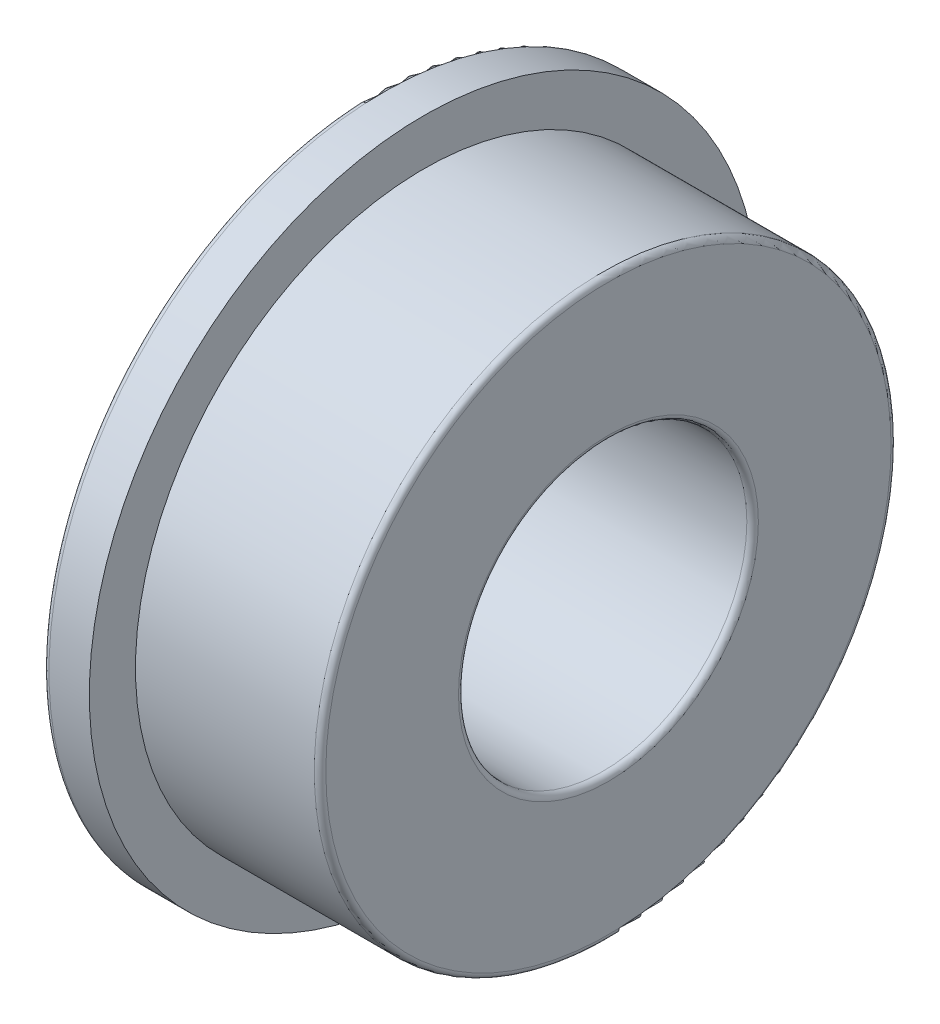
ISO-10303-21;
HEADER;
FILE_DESCRIPTION(('STEP AP214'),'2;1');
FILE_NAME('part.step','',(''),(''),'','','');
FILE_SCHEMA(('AUTOMOTIVE_DESIGN { 1 0 10303 214 1 1 1 1 }'));
ENDSEC;
DATA;
#1=APPLICATION_CONTEXT('core data for automotive mechanical design processes');
#2=APPLICATION_PROTOCOL_DEFINITION('international standard','automotive_design',2000,#1);
#3=PRODUCT_CONTEXT('',#1,'mechanical');
#4=PRODUCT('Part','Part','',(#3));
#5=PRODUCT_RELATED_PRODUCT_CATEGORY('part','',(#4));
#6=PRODUCT_DEFINITION_FORMATION('','',#4);
#7=PRODUCT_DEFINITION_CONTEXT('part definition',#1,'design');
#8=PRODUCT_DEFINITION('design','',#6,#7);
#9=PRODUCT_DEFINITION_SHAPE('','',#8);
#10=(LENGTH_UNIT() NAMED_UNIT(*) SI_UNIT(.MILLI.,.METRE.));
#11=(NAMED_UNIT(*) PLANE_ANGLE_UNIT() SI_UNIT($,.RADIAN.));
#12=(NAMED_UNIT(*) SI_UNIT($,.STERADIAN.) SOLID_ANGLE_UNIT());
#13=UNCERTAINTY_MEASURE_WITH_UNIT(LENGTH_MEASURE(1.E-05),#10,'distance_accuracy_value','');
#14=(GEOMETRIC_REPRESENTATION_CONTEXT(3) GLOBAL_UNCERTAINTY_ASSIGNED_CONTEXT((#13)) GLOBAL_UNIT_ASSIGNED_CONTEXT((#10,
#11,#12)) REPRESENTATION_CONTEXT('',''));
#15=CARTESIAN_POINT('',(0.,0.,0.));
#16=DIRECTION('',(0.,0.,1.));
#17=DIRECTION('',(1.,0.,0.));
#18=AXIS2_PLACEMENT_3D('',#15,#16,#17);
#19=CARTESIAN_POINT('',(0.8,0.,0.));
#20=DIRECTION('',(1.,0.,0.));
#21=DIRECTION('',(0.,0.,-1.));
#22=AXIS2_PLACEMENT_3D('',#19,#20,#21);
#23=PLANE('',#22);
#24=CARTESIAN_POINT('',(0.8,0.,0.));
#25=DIRECTION('',(1.,0.,0.));
#26=DIRECTION('',(0.,0.,-1.));
#27=AXIS2_PLACEMENT_3D('',#24,#25,#26);
#28=CIRCLE('',#27,5.8);
#29=CARTESIAN_POINT('',(0.8,0.,-5.8));
#30=VERTEX_POINT('',#29);
#31=EDGE_CURVE('E64',#30,#30,#28,.T.);
#32=ORIENTED_EDGE('',*,*,#31,.T.);
#33=EDGE_LOOP('',(#32));
#34=FACE_BOUND('',#33,.T.);
#35=CARTESIAN_POINT('',(0.8,0.,0.));
#36=DIRECTION('',(1.,0.,0.));
#37=DIRECTION('',(0.,0.,-1.));
#38=AXIS2_PLACEMENT_3D('',#35,#36,#37);
#39=CIRCLE('',#38,5.);
#40=CARTESIAN_POINT('',(0.8,0.,-5.));
#41=VERTEX_POINT('',#40);
#42=EDGE_CURVE('E67',#41,#41,#39,.T.);
#43=ORIENTED_EDGE('',*,*,#42,.F.);
#44=EDGE_LOOP('',(#43));
#45=FACE_BOUND('',#44,.T.);
#46=ADVANCED_FACE('F32',(#34,#45),#23,.T.);
#47=CARTESIAN_POINT('',(0.,0.,0.));
#48=DIRECTION('',(1.,0.,0.));
#49=DIRECTION('',(0.,0.,-1.));
#50=AXIS2_PLACEMENT_3D('',#47,#48,#49);
#51=PLANE('',#50);
#52=CARTESIAN_POINT('',(0.,0.,0.));
#53=DIRECTION('',(1.,0.,0.));
#54=DIRECTION('',(0.,0.,-1.));
#55=AXIS2_PLACEMENT_3D('',#52,#53,#54);
#56=CIRCLE('',#55,2.6);
#57=CARTESIAN_POINT('',(0.,0.,-2.6));
#58=VERTEX_POINT('',#57);
#59=EDGE_CURVE('E58',#58,#58,#56,.T.);
#60=ORIENTED_EDGE('',*,*,#59,.T.);
#61=EDGE_LOOP('',(#60));
#62=FACE_BOUND('',#61,.T.);
#63=CARTESIAN_POINT('',(0.,0.,0.));
#64=DIRECTION('',(1.,0.,0.));
#65=DIRECTION('',(0.,0.,-1.));
#66=AXIS2_PLACEMENT_3D('',#63,#64,#65);
#67=CIRCLE('',#66,5.7);
#68=CARTESIAN_POINT('',(0.,0.,-5.7));
#69=VERTEX_POINT('',#68);
#70=EDGE_CURVE('E61',#69,#69,#67,.F.);
#71=ORIENTED_EDGE('',*,*,#70,.T.);
#72=EDGE_LOOP('',(#71));
#73=FACE_BOUND('',#72,.T.);
#74=ADVANCED_FACE('F74',(#62,#73),#51,.F.);
#75=CARTESIAN_POINT('',(0.8,0.,0.));
#76=DIRECTION('',(-1.,0.,0.));
#77=DIRECTION('',(0.,0.,1.));
#78=AXIS2_PLACEMENT_3D('',#75,#76,#77);
#79=CYLINDRICAL_SURFACE('',#78,5.8);
#80=CARTESIAN_POINT('',(0.1,0.,0.));
#81=DIRECTION('',(1.,0.,0.));
#82=DIRECTION('',(0.,0.,-1.));
#83=AXIS2_PLACEMENT_3D('',#80,#81,#82);
#84=CIRCLE('',#83,5.8);
#85=CARTESIAN_POINT('',(0.1,0.,-5.8));
#86=VERTEX_POINT('',#85);
#87=EDGE_CURVE('E47',#86,#86,#84,.T.);
#88=ORIENTED_EDGE('',*,*,#87,.T.);
#89=EDGE_LOOP('',(#88));
#90=FACE_BOUND('',#89,.T.);
#91=ORIENTED_EDGE('',*,*,#31,.F.);
#92=EDGE_LOOP('',(#91));
#93=FACE_BOUND('',#92,.T.);
#94=ADVANCED_FACE('F80',(#90,#93),#79,.T.);
#95=CARTESIAN_POINT('',(0.8,0.,0.));
#96=DIRECTION('',(-1.,0.,0.));
#97=DIRECTION('',(0.,0.,1.));
#98=AXIS2_PLACEMENT_3D('',#95,#96,#97);
#99=CYLINDRICAL_SURFACE('',#98,2.5);
#100=CARTESIAN_POINT('',(0.1,0.,0.));
#101=DIRECTION('',(1.,0.,0.));
#102=DIRECTION('',(0.,0.,-1.));
#103=AXIS2_PLACEMENT_3D('',#100,#101,#102);
#104=CIRCLE('',#103,2.5);
#105=CARTESIAN_POINT('',(0.1,0.,-2.5));
#106=VERTEX_POINT('',#105);
#107=EDGE_CURVE('E52',#106,#106,#104,.F.);
#108=ORIENTED_EDGE('',*,*,#107,.T.);
#109=EDGE_LOOP('',(#108));
#110=FACE_BOUND('',#109,.T.);
#111=CARTESIAN_POINT('',(3.9,0.,0.));
#112=DIRECTION('',(1.,0.,0.));
#113=DIRECTION('',(0.,0.,-1.));
#114=AXIS2_PLACEMENT_3D('',#111,#112,#113);
#115=CIRCLE('',#114,2.5);
#116=CARTESIAN_POINT('',(3.9,0.,-2.5));
#117=VERTEX_POINT('',#116);
#118=EDGE_CURVE('E55',#117,#117,#115,.T.);
#119=ORIENTED_EDGE('',*,*,#118,.T.);
#120=EDGE_LOOP('',(#119));
#121=FACE_BOUND('',#120,.T.);
#122=ADVANCED_FACE('F84',(#110,#121),#99,.F.);
#123=CARTESIAN_POINT('',(4.,0.,0.));
#124=DIRECTION('',(1.,0.,0.));
#125=DIRECTION('',(0.,0.,-1.));
#126=AXIS2_PLACEMENT_3D('',#123,#124,#125);
#127=PLANE('',#126);
#128=CARTESIAN_POINT('',(4.,0.,0.));
#129=DIRECTION('',(1.,0.,0.));
#130=DIRECTION('',(0.,0.,-1.));
#131=AXIS2_PLACEMENT_3D('',#128,#129,#130);
#132=CIRCLE('',#131,2.6);
#133=CARTESIAN_POINT('',(4.,0.,-2.6));
#134=VERTEX_POINT('',#133);
#135=EDGE_CURVE('E39',#134,#134,#132,.F.);
#136=ORIENTED_EDGE('',*,*,#135,.T.);
#137=EDGE_LOOP('',(#136));
#138=FACE_BOUND('',#137,.T.);
#139=CARTESIAN_POINT('',(4.,0.,0.));
#140=DIRECTION('',(1.,0.,0.));
#141=DIRECTION('',(0.,0.,-1.));
#142=AXIS2_PLACEMENT_3D('',#139,#140,#141);
#143=CIRCLE('',#142,4.9);
#144=CARTESIAN_POINT('',(4.,0.,-4.9));
#145=VERTEX_POINT('',#144);
#146=EDGE_CURVE('E43',#145,#145,#143,.T.);
#147=ORIENTED_EDGE('',*,*,#146,.T.);
#148=EDGE_LOOP('',(#147));
#149=FACE_BOUND('',#148,.T.);
#150=ADVANCED_FACE('F108',(#138,#149),#127,.T.);
#151=CARTESIAN_POINT('',(4.,0.,0.));
#152=DIRECTION('',(-1.,0.,0.));
#153=DIRECTION('',(0.,0.,1.));
#154=AXIS2_PLACEMENT_3D('',#151,#152,#153);
#155=CYLINDRICAL_SURFACE('',#154,5.);
#156=CARTESIAN_POINT('',(3.9,0.,0.));
#157=DIRECTION('',(1.,0.,0.));
#158=DIRECTION('',(0.,0.,-1.));
#159=AXIS2_PLACEMENT_3D('',#156,#157,#158);
#160=CIRCLE('',#159,5.);
#161=CARTESIAN_POINT('',(3.9,0.,-5.));
#162=VERTEX_POINT('',#161);
#163=EDGE_CURVE('E10',#162,#162,#160,.F.);
#164=ORIENTED_EDGE('',*,*,#163,.T.);
#165=EDGE_LOOP('',(#164));
#166=FACE_BOUND('',#165,.T.);
#167=ORIENTED_EDGE('',*,*,#42,.T.);
#168=EDGE_LOOP('',(#167));
#169=FACE_BOUND('',#168,.T.);
#170=ADVANCED_FACE('F71',(#166,#169),#155,.T.);
#171=CARTESIAN_POINT('',(0.1,0.,0.));
#172=DIRECTION('',(1.,0.,0.));
#173=DIRECTION('',(0.,0.,-1.));
#174=AXIS2_PLACEMENT_3D('',#171,#172,#173);
#175=TOROIDAL_SURFACE('',#174,2.6,0.1);
#176=ORIENTED_EDGE('',*,*,#107,.F.);
#177=EDGE_LOOP('',(#176));
#178=FACE_BOUND('',#177,.T.);
#179=ORIENTED_EDGE('',*,*,#59,.F.);
#180=EDGE_LOOP('',(#179));
#181=FACE_BOUND('',#180,.T.);
#182=ADVANCED_FACE('F90',(#178,#181),#175,.T.);
#183=CARTESIAN_POINT('',(0.1,0.,0.));
#184=DIRECTION('',(1.,0.,0.));
#185=DIRECTION('',(0.,0.,-1.));
#186=AXIS2_PLACEMENT_3D('',#183,#184,#185);
#187=TOROIDAL_SURFACE('',#186,5.7,0.1);
#188=ORIENTED_EDGE('',*,*,#70,.F.);
#189=EDGE_LOOP('',(#188));
#190=FACE_BOUND('',#189,.T.);
#191=ORIENTED_EDGE('',*,*,#87,.F.);
#192=EDGE_LOOP('',(#191));
#193=FACE_BOUND('',#192,.T.);
#194=ADVANCED_FACE('F93',(#190,#193),#187,.T.);
#195=CARTESIAN_POINT('',(3.9,0.,0.));
#196=DIRECTION('',(1.,0.,0.));
#197=DIRECTION('',(0.,0.,-1.));
#198=AXIS2_PLACEMENT_3D('',#195,#196,#197);
#199=TOROIDAL_SURFACE('',#198,2.6,0.1);
#200=ORIENTED_EDGE('',*,*,#135,.F.);
#201=EDGE_LOOP('',(#200));
#202=FACE_BOUND('',#201,.T.);
#203=ORIENTED_EDGE('',*,*,#118,.F.);
#204=EDGE_LOOP('',(#203));
#205=FACE_BOUND('',#204,.T.);
#206=ADVANCED_FACE('F96',(#202,#205),#199,.T.);
#207=CARTESIAN_POINT('',(3.9,0.,0.));
#208=DIRECTION('',(1.,0.,0.));
#209=DIRECTION('',(0.,0.,-1.));
#210=AXIS2_PLACEMENT_3D('',#207,#208,#209);
#211=TOROIDAL_SURFACE('',#210,4.9,0.1);
#212=ORIENTED_EDGE('',*,*,#163,.F.);
#213=EDGE_LOOP('',(#212));
#214=FACE_BOUND('',#213,.T.);
#215=ORIENTED_EDGE('',*,*,#146,.F.);
#216=EDGE_LOOP('',(#215));
#217=FACE_BOUND('',#216,.T.);
#218=ADVANCED_FACE('F34',(#214,#217),#211,.T.);
#219=CLOSED_SHELL('',(#46,#74,#94,#122,#150,#170,#182,#194,#206,#218));
#220=MANIFOLD_SOLID_BREP('B2',#219);
#221=ADVANCED_BREP_SHAPE_REPRESENTATION('',(#18,#220),#14);
#222=SHAPE_DEFINITION_REPRESENTATION(#9,#221);
ENDSEC;
END-ISO-10303-21;
